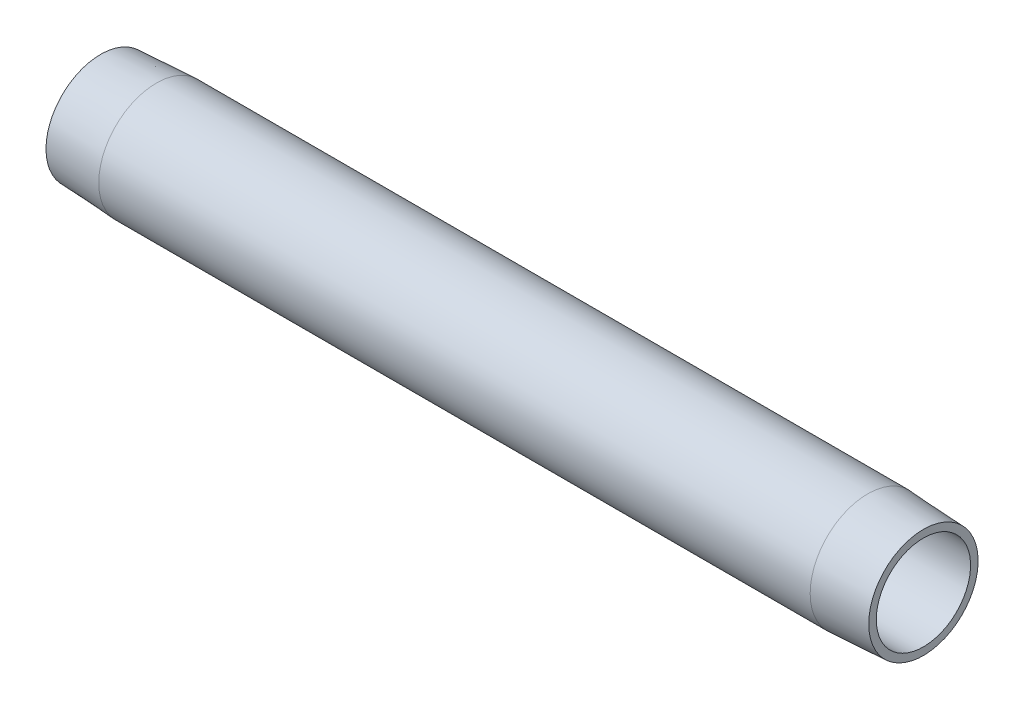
from build123d import *


with BuildPart() as part:
    # Sketch1 → Revolve1 (revolve)
    with BuildSketch(Plane.XY, mode=Mode.PRIVATE) as revolve1_sk:
        Polygon((152.4, 8.73125), (0, 8.73125), (0, 10.127550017), (10.3124, 10.668), (142.0876, 10.668), (152.4, 10.127550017), align=None)
    revolve(revolve1_sk.sketch.rotate(Axis((0, 0, 0), (1, 0, 0)), 90), axis=Axis((0, 0, 0), (1, 0, 0)))


solid = part.part
